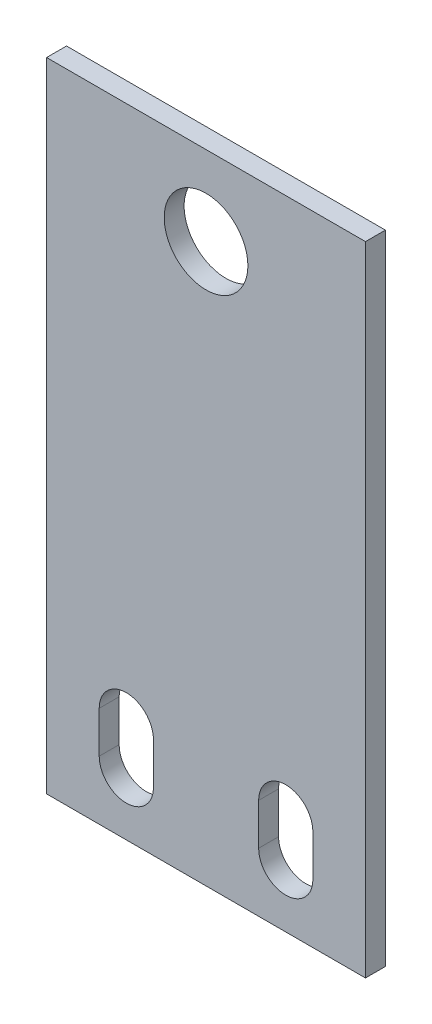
ISO-10303-21;
HEADER;
FILE_DESCRIPTION(('STEP AP214'),'2;1');
FILE_NAME('part.step','',(''),(''),'','','');
FILE_SCHEMA(('AUTOMOTIVE_DESIGN { 1 0 10303 214 1 1 1 1 }'));
ENDSEC;
DATA;
#1=APPLICATION_CONTEXT('core data for automotive mechanical design processes');
#2=APPLICATION_PROTOCOL_DEFINITION('international standard','automotive_design',2000,#1);
#3=PRODUCT_CONTEXT('',#1,'mechanical');
#4=PRODUCT('Part','Part','',(#3));
#5=PRODUCT_RELATED_PRODUCT_CATEGORY('part','',(#4));
#6=PRODUCT_DEFINITION_FORMATION('','',#4);
#7=PRODUCT_DEFINITION_CONTEXT('part definition',#1,'design');
#8=PRODUCT_DEFINITION('design','',#6,#7);
#9=PRODUCT_DEFINITION_SHAPE('','',#8);
#10=(LENGTH_UNIT() NAMED_UNIT(*) SI_UNIT(.MILLI.,.METRE.));
#11=(NAMED_UNIT(*) PLANE_ANGLE_UNIT() SI_UNIT($,.RADIAN.));
#12=(NAMED_UNIT(*) SI_UNIT($,.STERADIAN.) SOLID_ANGLE_UNIT());
#13=UNCERTAINTY_MEASURE_WITH_UNIT(LENGTH_MEASURE(1.E-05),#10,'distance_accuracy_value','');
#14=(GEOMETRIC_REPRESENTATION_CONTEXT(3) GLOBAL_UNCERTAINTY_ASSIGNED_CONTEXT((#13)) GLOBAL_UNIT_ASSIGNED_CONTEXT((#10,
#11,#12)) REPRESENTATION_CONTEXT('',''));
#15=CARTESIAN_POINT('',(0.,0.,0.));
#16=DIRECTION('',(0.,0.,1.));
#17=DIRECTION('',(1.,0.,0.));
#18=AXIS2_PLACEMENT_3D('',#15,#16,#17);
#19=CARTESIAN_POINT('',(-20.,0.,2.5));
#20=DIRECTION('',(0.,0.,1.));
#21=DIRECTION('',(1.,0.,0.));
#22=AXIS2_PLACEMENT_3D('',#19,#20,#21);
#23=PLANE('',#22);
#24=DIRECTION('',(0.,-1.,0.));
#25=VECTOR('',#24,1.);
#26=CARTESIAN_POINT('',(-13.4,12.6,2.5));
#27=LINE('',#26,#25);
#28=CARTESIAN_POINT('',(-13.4,12.6,2.5));
#29=VERTEX_POINT('',#28);
#30=CARTESIAN_POINT('',(-13.4,7.4,2.5));
#31=VERTEX_POINT('',#30);
#32=EDGE_CURVE('E194',#29,#31,#27,.T.);
#33=ORIENTED_EDGE('',*,*,#32,.F.);
#34=CARTESIAN_POINT('',(-10.,12.6,2.5));
#35=DIRECTION('',(0.,0.,1.));
#36=DIRECTION('',(-1.,0.,0.));
#37=AXIS2_PLACEMENT_3D('',#34,#35,#36);
#38=CIRCLE('',#37,3.4);
#39=CARTESIAN_POINT('',(-6.6,12.6,2.5));
#40=VERTEX_POINT('',#39);
#41=EDGE_CURVE('E191',#40,#29,#38,.T.);
#42=ORIENTED_EDGE('',*,*,#41,.F.);
#43=DIRECTION('',(0.,1.,0.));
#44=VECTOR('',#43,1.);
#45=CARTESIAN_POINT('',(-6.6,12.6,2.5));
#46=LINE('',#45,#44);
#47=CARTESIAN_POINT('',(-6.6,7.4,2.5));
#48=VERTEX_POINT('',#47);
#49=EDGE_CURVE('E201',#48,#40,#46,.T.);
#50=ORIENTED_EDGE('',*,*,#49,.F.);
#51=CARTESIAN_POINT('',(-10.,7.4,2.5));
#52=DIRECTION('',(0.,0.,1.));
#53=DIRECTION('',(1.,0.,0.));
#54=AXIS2_PLACEMENT_3D('',#51,#52,#53);
#55=CIRCLE('',#54,3.4);
#56=EDGE_CURVE('E197',#31,#48,#55,.T.);
#57=ORIENTED_EDGE('',*,*,#56,.F.);
#58=EDGE_LOOP('',(#33,#42,#50,#57));
#59=FACE_BOUND('',#58,.T.);
#60=DIRECTION('',(0.,-1.,0.));
#61=VECTOR('',#60,1.);
#62=CARTESIAN_POINT('',(-20.,80.,2.5));
#63=LINE('',#62,#61);
#64=CARTESIAN_POINT('',(-20.,80.,2.5));
#65=VERTEX_POINT('',#64);
#66=CARTESIAN_POINT('',(-20.,0.,2.5));
#67=VERTEX_POINT('',#66);
#68=EDGE_CURVE('E239',#65,#67,#63,.T.);
#69=ORIENTED_EDGE('',*,*,#68,.T.);
#70=DIRECTION('',(1.,0.,0.));
#71=VECTOR('',#70,1.);
#72=CARTESIAN_POINT('',(-20.,0.,2.5));
#73=LINE('',#72,#71);
#74=CARTESIAN_POINT('',(20.,0.,2.5));
#75=VERTEX_POINT('',#74);
#76=EDGE_CURVE('E243',#67,#75,#73,.T.);
#77=ORIENTED_EDGE('',*,*,#76,.T.);
#78=DIRECTION('',(0.,1.,0.));
#79=VECTOR('',#78,1.);
#80=CARTESIAN_POINT('',(20.,80.,2.5));
#81=LINE('',#80,#79);
#82=CARTESIAN_POINT('',(20.,80.,2.5));
#83=VERTEX_POINT('',#82);
#84=EDGE_CURVE('E246',#75,#83,#81,.T.);
#85=ORIENTED_EDGE('',*,*,#84,.T.);
#86=DIRECTION('',(-1.,0.,0.));
#87=VECTOR('',#86,1.);
#88=CARTESIAN_POINT('',(-20.,80.,2.5));
#89=LINE('',#88,#87);
#90=EDGE_CURVE('E249',#83,#65,#89,.T.);
#91=ORIENTED_EDGE('',*,*,#90,.T.);
#92=EDGE_LOOP('',(#69,#77,#85,#91));
#93=FACE_BOUND('',#92,.T.);
#94=CARTESIAN_POINT('',(0.,70.,2.5));
#95=DIRECTION('',(0.,0.,1.));
#96=DIRECTION('',(1.,0.,0.));
#97=AXIS2_PLACEMENT_3D('',#94,#95,#96);
#98=CIRCLE('',#97,5.25);
#99=CARTESIAN_POINT('',(5.25,70.,2.5));
#100=VERTEX_POINT('',#99);
#101=EDGE_CURVE('E222',#100,#100,#98,.T.);
#102=ORIENTED_EDGE('',*,*,#101,.F.);
#103=EDGE_LOOP('',(#102));
#104=FACE_BOUND('',#103,.T.);
#105=DIRECTION('',(0.,-1.,0.));
#106=VECTOR('',#105,1.);
#107=CARTESIAN_POINT('',(6.60000000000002,12.6,2.5));
#108=LINE('',#107,#106);
#109=CARTESIAN_POINT('',(6.60000000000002,12.6,2.5));
#110=VERTEX_POINT('',#109);
#111=CARTESIAN_POINT('',(6.60000000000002,7.4,2.5));
#112=VERTEX_POINT('',#111);
#113=EDGE_CURVE('E161',#110,#112,#108,.T.);
#114=ORIENTED_EDGE('',*,*,#113,.F.);
#115=CARTESIAN_POINT('',(10.,12.6,2.5));
#116=DIRECTION('',(0.,0.,1.));
#117=DIRECTION('',(-1.,0.,0.));
#118=AXIS2_PLACEMENT_3D('',#115,#116,#117);
#119=CIRCLE('',#118,3.4);
#120=CARTESIAN_POINT('',(13.4,12.6,2.5));
#121=VERTEX_POINT('',#120);
#122=EDGE_CURVE('E144',#121,#110,#119,.T.);
#123=ORIENTED_EDGE('',*,*,#122,.F.);
#124=DIRECTION('',(0.,1.,0.));
#125=VECTOR('',#124,1.);
#126=CARTESIAN_POINT('',(13.4,12.6,2.5));
#127=LINE('',#126,#125);
#128=CARTESIAN_POINT('',(13.4,7.4,2.5));
#129=VERTEX_POINT('',#128);
#130=EDGE_CURVE('E167',#129,#121,#127,.T.);
#131=ORIENTED_EDGE('',*,*,#130,.F.);
#132=CARTESIAN_POINT('',(10.,7.4,2.5));
#133=DIRECTION('',(0.,0.,1.));
#134=DIRECTION('',(1.,0.,0.));
#135=AXIS2_PLACEMENT_3D('',#132,#133,#134);
#136=CIRCLE('',#135,3.4);
#137=EDGE_CURVE('E164',#112,#129,#136,.T.);
#138=ORIENTED_EDGE('',*,*,#137,.F.);
#139=EDGE_LOOP('',(#114,#123,#131,#138));
#140=FACE_BOUND('',#139,.T.);
#141=ADVANCED_FACE('F38',(#59,#93,#104,#140),#23,.T.);
#142=CARTESIAN_POINT('',(-20.,0.,0.));
#143=DIRECTION('',(0.,0.,1.));
#144=DIRECTION('',(1.,0.,0.));
#145=AXIS2_PLACEMENT_3D('',#142,#143,#144);
#146=PLANE('',#145);
#147=CARTESIAN_POINT('',(-10.,12.6,0.));
#148=DIRECTION('',(0.,0.,1.));
#149=DIRECTION('',(-1.,0.,0.));
#150=AXIS2_PLACEMENT_3D('',#147,#148,#149);
#151=CIRCLE('',#150,3.4);
#152=CARTESIAN_POINT('',(-6.6,12.6,0.));
#153=VERTEX_POINT('',#152);
#154=CARTESIAN_POINT('',(-13.4,12.6,0.));
#155=VERTEX_POINT('',#154);
#156=EDGE_CURVE('E146',#153,#155,#151,.T.);
#157=ORIENTED_EDGE('',*,*,#156,.T.);
#158=DIRECTION('',(0.,-1.,0.));
#159=VECTOR('',#158,1.);
#160=CARTESIAN_POINT('',(-13.4,12.6,0.));
#161=LINE('',#160,#159);
#162=CARTESIAN_POINT('',(-13.4,7.4,0.));
#163=VERTEX_POINT('',#162);
#164=EDGE_CURVE('E179',#155,#163,#161,.T.);
#165=ORIENTED_EDGE('',*,*,#164,.T.);
#166=CARTESIAN_POINT('',(-10.,7.4,0.));
#167=DIRECTION('',(0.,0.,1.));
#168=DIRECTION('',(1.,0.,0.));
#169=AXIS2_PLACEMENT_3D('',#166,#167,#168);
#170=CIRCLE('',#169,3.4);
#171=CARTESIAN_POINT('',(-6.6,7.4,0.));
#172=VERTEX_POINT('',#171);
#173=EDGE_CURVE('E183',#163,#172,#170,.T.);
#174=ORIENTED_EDGE('',*,*,#173,.T.);
#175=DIRECTION('',(0.,1.,0.));
#176=VECTOR('',#175,1.);
#177=CARTESIAN_POINT('',(-6.6,12.6,0.));
#178=LINE('',#177,#176);
#179=EDGE_CURVE('E187',#172,#153,#178,.T.);
#180=ORIENTED_EDGE('',*,*,#179,.T.);
#181=EDGE_LOOP('',(#157,#165,#174,#180));
#182=FACE_BOUND('',#181,.T.);
#183=DIRECTION('',(0.,-1.,0.));
#184=VECTOR('',#183,1.);
#185=CARTESIAN_POINT('',(-20.,80.,0.));
#186=LINE('',#185,#184);
#187=CARTESIAN_POINT('',(-20.,80.,0.));
#188=VERTEX_POINT('',#187);
#189=CARTESIAN_POINT('',(-20.,0.,0.));
#190=VERTEX_POINT('',#189);
#191=EDGE_CURVE('E226',#188,#190,#186,.T.);
#192=ORIENTED_EDGE('',*,*,#191,.F.);
#193=DIRECTION('',(-1.,0.,0.));
#194=VECTOR('',#193,1.);
#195=CARTESIAN_POINT('',(-20.,80.,0.));
#196=LINE('',#195,#194);
#197=CARTESIAN_POINT('',(20.,80.,0.));
#198=VERTEX_POINT('',#197);
#199=EDGE_CURVE('E236',#198,#188,#196,.T.);
#200=ORIENTED_EDGE('',*,*,#199,.F.);
#201=DIRECTION('',(0.,1.,0.));
#202=VECTOR('',#201,1.);
#203=CARTESIAN_POINT('',(20.,80.,0.));
#204=LINE('',#203,#202);
#205=CARTESIAN_POINT('',(20.,0.,0.));
#206=VERTEX_POINT('',#205);
#207=EDGE_CURVE('E233',#206,#198,#204,.T.);
#208=ORIENTED_EDGE('',*,*,#207,.F.);
#209=DIRECTION('',(1.,0.,0.));
#210=VECTOR('',#209,1.);
#211=CARTESIAN_POINT('',(-20.,0.,0.));
#212=LINE('',#211,#210);
#213=EDGE_CURVE('E230',#190,#206,#212,.T.);
#214=ORIENTED_EDGE('',*,*,#213,.F.);
#215=EDGE_LOOP('',(#192,#200,#208,#214));
#216=FACE_BOUND('',#215,.T.);
#217=CARTESIAN_POINT('',(0.,70.,0.));
#218=DIRECTION('',(0.,0.,1.));
#219=DIRECTION('',(1.,0.,0.));
#220=AXIS2_PLACEMENT_3D('',#217,#218,#219);
#221=CIRCLE('',#220,5.25);
#222=CARTESIAN_POINT('',(5.25,70.,0.));
#223=VERTEX_POINT('',#222);
#224=EDGE_CURVE('E218',#223,#223,#221,.T.);
#225=ORIENTED_EDGE('',*,*,#224,.T.);
#226=EDGE_LOOP('',(#225));
#227=FACE_BOUND('',#226,.T.);
#228=CARTESIAN_POINT('',(10.,12.6,0.));
#229=DIRECTION('',(0.,0.,1.));
#230=DIRECTION('',(-1.,0.,0.));
#231=AXIS2_PLACEMENT_3D('',#228,#229,#230);
#232=CIRCLE('',#231,3.4);
#233=CARTESIAN_POINT('',(13.4,12.6,0.));
#234=VERTEX_POINT('',#233);
#235=CARTESIAN_POINT('',(6.60000000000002,12.6,0.));
#236=VERTEX_POINT('',#235);
#237=EDGE_CURVE('E62',#234,#236,#232,.T.);
#238=ORIENTED_EDGE('',*,*,#237,.T.);
#239=DIRECTION('',(0.,-1.,0.));
#240=VECTOR('',#239,1.);
#241=CARTESIAN_POINT('',(6.60000000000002,12.6,0.));
#242=LINE('',#241,#240);
#243=CARTESIAN_POINT('',(6.60000000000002,7.4,0.));
#244=VERTEX_POINT('',#243);
#245=EDGE_CURVE('E130',#236,#244,#242,.T.);
#246=ORIENTED_EDGE('',*,*,#245,.T.);
#247=CARTESIAN_POINT('',(10.,7.4,0.));
#248=DIRECTION('',(0.,0.,1.));
#249=DIRECTION('',(1.,0.,0.));
#250=AXIS2_PLACEMENT_3D('',#247,#248,#249);
#251=CIRCLE('',#250,3.4);
#252=CARTESIAN_POINT('',(13.4,7.4,0.));
#253=VERTEX_POINT('',#252);
#254=EDGE_CURVE('E140',#244,#253,#251,.T.);
#255=ORIENTED_EDGE('',*,*,#254,.T.);
#256=DIRECTION('',(0.,1.,0.));
#257=VECTOR('',#256,1.);
#258=CARTESIAN_POINT('',(13.4,12.6,0.));
#259=LINE('',#258,#257);
#260=EDGE_CURVE('E150',#253,#234,#259,.T.);
#261=ORIENTED_EDGE('',*,*,#260,.T.);
#262=EDGE_LOOP('',(#238,#246,#255,#261));
#263=FACE_BOUND('',#262,.T.);
#264=ADVANCED_FACE('F149',(#182,#216,#227,#263),#146,.F.);
#265=CARTESIAN_POINT('',(-20.,80.,2.5));
#266=DIRECTION('',(1.,0.,0.));
#267=DIRECTION('',(0.,1.,0.));
#268=AXIS2_PLACEMENT_3D('',#265,#266,#267);
#269=PLANE('',#268);
#270=ORIENTED_EDGE('',*,*,#191,.T.);
#271=DIRECTION('',(0.,0.,-1.));
#272=VECTOR('',#271,1.);
#273=CARTESIAN_POINT('',(-20.,0.,2.5));
#274=LINE('',#273,#272);
#275=EDGE_CURVE('E11',#67,#190,#274,.T.);
#276=ORIENTED_EDGE('',*,*,#275,.F.);
#277=ORIENTED_EDGE('',*,*,#68,.F.);
#278=DIRECTION('',(0.,0.,-1.));
#279=VECTOR('',#278,1.);
#280=CARTESIAN_POINT('',(-20.,80.,2.5));
#281=LINE('',#280,#279);
#282=EDGE_CURVE('E252',#65,#188,#281,.T.);
#283=ORIENTED_EDGE('',*,*,#282,.T.);
#284=EDGE_LOOP('',(#270,#276,#277,#283));
#285=FACE_BOUND('',#284,.T.);
#286=ADVANCED_FACE('F40',(#285),#269,.F.);
#287=CARTESIAN_POINT('',(-20.,0.,2.5));
#288=DIRECTION('',(0.,1.,0.));
#289=DIRECTION('',(0.,0.,1.));
#290=AXIS2_PLACEMENT_3D('',#287,#288,#289);
#291=PLANE('',#290);
#292=ORIENTED_EDGE('',*,*,#213,.T.);
#293=DIRECTION('',(0.,0.,-1.));
#294=VECTOR('',#293,1.);
#295=CARTESIAN_POINT('',(20.,0.,2.5));
#296=LINE('',#295,#294);
#297=EDGE_CURVE('E47',#75,#206,#296,.T.);
#298=ORIENTED_EDGE('',*,*,#297,.F.);
#299=ORIENTED_EDGE('',*,*,#76,.F.);
#300=ORIENTED_EDGE('',*,*,#275,.T.);
#301=EDGE_LOOP('',(#292,#298,#299,#300));
#302=FACE_BOUND('',#301,.T.);
#303=ADVANCED_FACE('F281',(#302),#291,.F.);
#304=CARTESIAN_POINT('',(20.,80.,2.5));
#305=DIRECTION('',(-1.,0.,0.));
#306=DIRECTION('',(0.,-1.,0.));
#307=AXIS2_PLACEMENT_3D('',#304,#305,#306);
#308=PLANE('',#307);
#309=ORIENTED_EDGE('',*,*,#207,.T.);
#310=DIRECTION('',(0.,0.,-1.));
#311=VECTOR('',#310,1.);
#312=CARTESIAN_POINT('',(20.,80.,2.5));
#313=LINE('',#312,#311);
#314=EDGE_CURVE('E256',#83,#198,#313,.T.);
#315=ORIENTED_EDGE('',*,*,#314,.F.);
#316=ORIENTED_EDGE('',*,*,#84,.F.);
#317=ORIENTED_EDGE('',*,*,#297,.T.);
#318=EDGE_LOOP('',(#309,#315,#316,#317));
#319=FACE_BOUND('',#318,.T.);
#320=ADVANCED_FACE('F265',(#319),#308,.F.);
#321=CARTESIAN_POINT('',(-20.,80.,2.5));
#322=DIRECTION('',(0.,-1.,0.));
#323=DIRECTION('',(0.,0.,-1.));
#324=AXIS2_PLACEMENT_3D('',#321,#322,#323);
#325=PLANE('',#324);
#326=ORIENTED_EDGE('',*,*,#199,.T.);
#327=ORIENTED_EDGE('',*,*,#282,.F.);
#328=ORIENTED_EDGE('',*,*,#90,.F.);
#329=ORIENTED_EDGE('',*,*,#314,.T.);
#330=EDGE_LOOP('',(#326,#327,#328,#329));
#331=FACE_BOUND('',#330,.T.);
#332=ADVANCED_FACE('F274',(#331),#325,.F.);
#333=CARTESIAN_POINT('',(0.,70.,2.5));
#334=DIRECTION('',(0.,0.,-1.));
#335=DIRECTION('',(-1.,0.,0.));
#336=AXIS2_PLACEMENT_3D('',#333,#334,#335);
#337=CYLINDRICAL_SURFACE('',#336,5.25);
#338=ORIENTED_EDGE('',*,*,#101,.T.);
#339=EDGE_LOOP('',(#338));
#340=FACE_BOUND('',#339,.T.);
#341=ORIENTED_EDGE('',*,*,#224,.F.);
#342=EDGE_LOOP('',(#341));
#343=FACE_BOUND('',#342,.T.);
#344=ADVANCED_FACE('F300',(#340,#343),#337,.F.);
#345=CARTESIAN_POINT('',(-10.,12.6,2.5));
#346=DIRECTION('',(0.,0.,-1.));
#347=DIRECTION('',(-1.,0.,0.));
#348=AXIS2_PLACEMENT_3D('',#345,#346,#347);
#349=CYLINDRICAL_SURFACE('',#348,3.4);
#350=ORIENTED_EDGE('',*,*,#156,.F.);
#351=DIRECTION('',(0.,0.,-1.));
#352=VECTOR('',#351,1.);
#353=CARTESIAN_POINT('',(-6.6,12.6,2.5));
#354=LINE('',#353,#352);
#355=EDGE_CURVE('E204',#40,#153,#354,.T.);
#356=ORIENTED_EDGE('',*,*,#355,.F.);
#357=ORIENTED_EDGE('',*,*,#41,.T.);
#358=DIRECTION('',(0.,0.,-1.));
#359=VECTOR('',#358,1.);
#360=CARTESIAN_POINT('',(-13.4,12.6,2.5));
#361=LINE('',#360,#359);
#362=EDGE_CURVE('E214',#29,#155,#361,.T.);
#363=ORIENTED_EDGE('',*,*,#362,.T.);
#364=EDGE_LOOP('',(#350,#356,#357,#363));
#365=FACE_BOUND('',#364,.T.);
#366=ADVANCED_FACE('F304',(#365),#349,.F.);
#367=CARTESIAN_POINT('',(-13.4,12.6,2.5));
#368=DIRECTION('',(1.,0.,0.));
#369=DIRECTION('',(0.,0.,-1.));
#370=AXIS2_PLACEMENT_3D('',#367,#368,#369);
#371=PLANE('',#370);
#372=ORIENTED_EDGE('',*,*,#164,.F.);
#373=ORIENTED_EDGE('',*,*,#362,.F.);
#374=ORIENTED_EDGE('',*,*,#32,.T.);
#375=DIRECTION('',(0.,0.,-1.));
#376=VECTOR('',#375,1.);
#377=CARTESIAN_POINT('',(-13.4,7.4,2.5));
#378=LINE('',#377,#376);
#379=EDGE_CURVE('E211',#31,#163,#378,.T.);
#380=ORIENTED_EDGE('',*,*,#379,.T.);
#381=EDGE_LOOP('',(#372,#373,#374,#380));
#382=FACE_BOUND('',#381,.T.);
#383=ADVANCED_FACE('F309',(#382),#371,.T.);
#384=CARTESIAN_POINT('',(-10.,7.4,2.5));
#385=DIRECTION('',(0.,0.,-1.));
#386=DIRECTION('',(-1.,0.,0.));
#387=AXIS2_PLACEMENT_3D('',#384,#385,#386);
#388=CYLINDRICAL_SURFACE('',#387,3.4);
#389=ORIENTED_EDGE('',*,*,#173,.F.);
#390=ORIENTED_EDGE('',*,*,#379,.F.);
#391=ORIENTED_EDGE('',*,*,#56,.T.);
#392=DIRECTION('',(0.,0.,-1.));
#393=VECTOR('',#392,1.);
#394=CARTESIAN_POINT('',(-6.6,7.4,2.5));
#395=LINE('',#394,#393);
#396=EDGE_CURVE('E208',#48,#172,#395,.T.);
#397=ORIENTED_EDGE('',*,*,#396,.T.);
#398=EDGE_LOOP('',(#389,#390,#391,#397));
#399=FACE_BOUND('',#398,.T.);
#400=ADVANCED_FACE('F316',(#399),#388,.F.);
#401=CARTESIAN_POINT('',(-6.6,12.6,2.5));
#402=DIRECTION('',(-1.,0.,0.));
#403=DIRECTION('',(0.,0.,1.));
#404=AXIS2_PLACEMENT_3D('',#401,#402,#403);
#405=PLANE('',#404);
#406=ORIENTED_EDGE('',*,*,#179,.F.);
#407=ORIENTED_EDGE('',*,*,#396,.F.);
#408=ORIENTED_EDGE('',*,*,#49,.T.);
#409=ORIENTED_EDGE('',*,*,#355,.T.);
#410=EDGE_LOOP('',(#406,#407,#408,#409));
#411=FACE_BOUND('',#410,.T.);
#412=ADVANCED_FACE('F320',(#411),#405,.T.);
#413=CARTESIAN_POINT('',(10.,12.6,2.5));
#414=DIRECTION('',(0.,0.,-1.));
#415=DIRECTION('',(-1.,0.,0.));
#416=AXIS2_PLACEMENT_3D('',#413,#414,#415);
#417=CYLINDRICAL_SURFACE('',#416,3.4);
#418=ORIENTED_EDGE('',*,*,#237,.F.);
#419=DIRECTION('',(0.,0.,-1.));
#420=VECTOR('',#419,1.);
#421=CARTESIAN_POINT('',(13.4,12.6,2.5));
#422=LINE('',#421,#420);
#423=EDGE_CURVE('E169',#121,#234,#422,.T.);
#424=ORIENTED_EDGE('',*,*,#423,.F.);
#425=ORIENTED_EDGE('',*,*,#122,.T.);
#426=DIRECTION('',(0.,0.,-1.));
#427=VECTOR('',#426,1.);
#428=CARTESIAN_POINT('',(6.60000000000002,12.6,2.5));
#429=LINE('',#428,#427);
#430=EDGE_CURVE('E132',#110,#236,#429,.T.);
#431=ORIENTED_EDGE('',*,*,#430,.T.);
#432=EDGE_LOOP('',(#418,#424,#425,#431));
#433=FACE_BOUND('',#432,.T.);
#434=ADVANCED_FACE('F142',(#433),#417,.F.);
#435=CARTESIAN_POINT('',(6.60000000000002,12.6,2.5));
#436=DIRECTION('',(1.,0.,0.));
#437=DIRECTION('',(0.,0.,-1.));
#438=AXIS2_PLACEMENT_3D('',#435,#436,#437);
#439=PLANE('',#438);
#440=ORIENTED_EDGE('',*,*,#245,.F.);
#441=ORIENTED_EDGE('',*,*,#430,.F.);
#442=ORIENTED_EDGE('',*,*,#113,.T.);
#443=DIRECTION('',(0.,0.,-1.));
#444=VECTOR('',#443,1.);
#445=CARTESIAN_POINT('',(6.60000000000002,7.4,2.5));
#446=LINE('',#445,#444);
#447=EDGE_CURVE('E135',#112,#244,#446,.T.);
#448=ORIENTED_EDGE('',*,*,#447,.T.);
#449=EDGE_LOOP('',(#440,#441,#442,#448));
#450=FACE_BOUND('',#449,.T.);
#451=ADVANCED_FACE('F131',(#450),#439,.T.);
#452=CARTESIAN_POINT('',(10.,7.4,2.5));
#453=DIRECTION('',(0.,0.,-1.));
#454=DIRECTION('',(-1.,0.,0.));
#455=AXIS2_PLACEMENT_3D('',#452,#453,#454);
#456=CYLINDRICAL_SURFACE('',#455,3.4);
#457=ORIENTED_EDGE('',*,*,#254,.F.);
#458=ORIENTED_EDGE('',*,*,#447,.F.);
#459=ORIENTED_EDGE('',*,*,#137,.T.);
#460=DIRECTION('',(0.,0.,-1.));
#461=VECTOR('',#460,1.);
#462=CARTESIAN_POINT('',(13.4,7.4,2.5));
#463=LINE('',#462,#461);
#464=EDGE_CURVE('E54',#129,#253,#463,.T.);
#465=ORIENTED_EDGE('',*,*,#464,.T.);
#466=EDGE_LOOP('',(#457,#458,#459,#465));
#467=FACE_BOUND('',#466,.T.);
#468=ADVANCED_FACE('F329',(#467),#456,.F.);
#469=CARTESIAN_POINT('',(13.4,12.6,2.5));
#470=DIRECTION('',(-1.,0.,0.));
#471=DIRECTION('',(0.,0.,1.));
#472=AXIS2_PLACEMENT_3D('',#469,#470,#471);
#473=PLANE('',#472);
#474=ORIENTED_EDGE('',*,*,#260,.F.);
#475=ORIENTED_EDGE('',*,*,#464,.F.);
#476=ORIENTED_EDGE('',*,*,#130,.T.);
#477=ORIENTED_EDGE('',*,*,#423,.T.);
#478=EDGE_LOOP('',(#474,#475,#476,#477));
#479=FACE_BOUND('',#478,.T.);
#480=ADVANCED_FACE('F332',(#479),#473,.T.);
#481=CLOSED_SHELL('',(#141,#264,#286,#303,#320,#332,#344,#366,#383,#400,#412,#434,#451,#468,#480));
#482=MANIFOLD_SOLID_BREP('B2',#481);
#483=ADVANCED_BREP_SHAPE_REPRESENTATION('',(#18,#482),#14);
#484=SHAPE_DEFINITION_REPRESENTATION(#9,#483);
ENDSEC;
END-ISO-10303-21;
